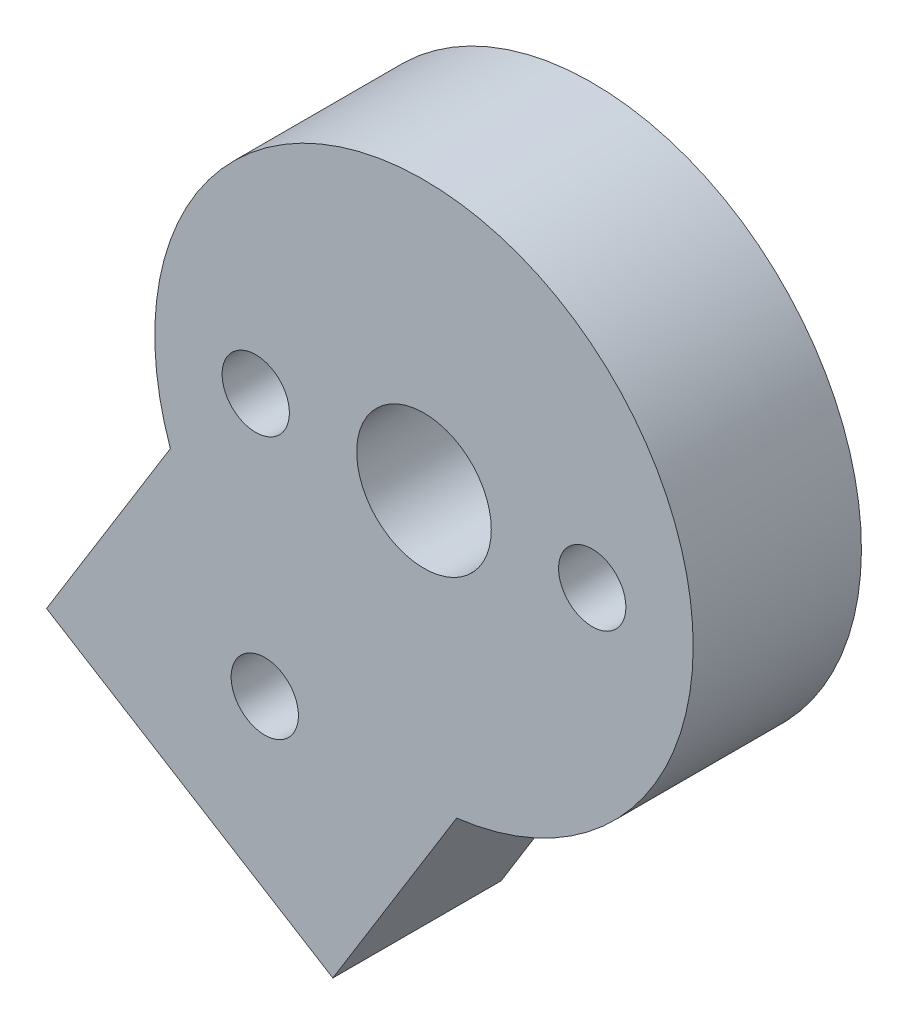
from build123d import *

# Parameters (mm, degrees)
BOSS_EXTRUDE1_DEPTH = 5
SKETCH2_R           = 2
SKETCH2_R_2         = 1
CUT_EXTRUDE1_DEPTH  = 5


with BuildPart() as part:
    # Sketch1 → Boss-Extrude1 (new body)
    with BuildSketch(Plane.XY):
        with BuildLine():
            Line((-7.536140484, -2.684508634), (-11.215585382, -8.639480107))
            Line((-11.215585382, -8.639480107), (-2.708483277, -13.895829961))
            Line((-2.708483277, -13.895829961), (0.97096162, -7.940858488))
            ThreePointArc((0.97096162, -7.940858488), (4.205079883, 6.805681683), (-7.536140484, -2.684508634))
        make_face()
    extrude(amount=BOSS_EXTRUDE1_DEPTH)

    # Sketch2 → Cut-Extrude1 (cut)
    with BuildSketch(Plane.XY.offset(5)):
        Circle(SKETCH2_R)
        with Locations((-4.730714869, -7.656391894)):
            Circle(SKETCH2_R_2)
        with Locations((5, 0)):
            Circle(SKETCH2_R_2)
        with Locations((-5, 0)):
            Circle(SKETCH2_R_2)
    extrude(amount=-CUT_EXTRUDE1_DEPTH, mode=Mode.SUBTRACT)


solid = part.part
